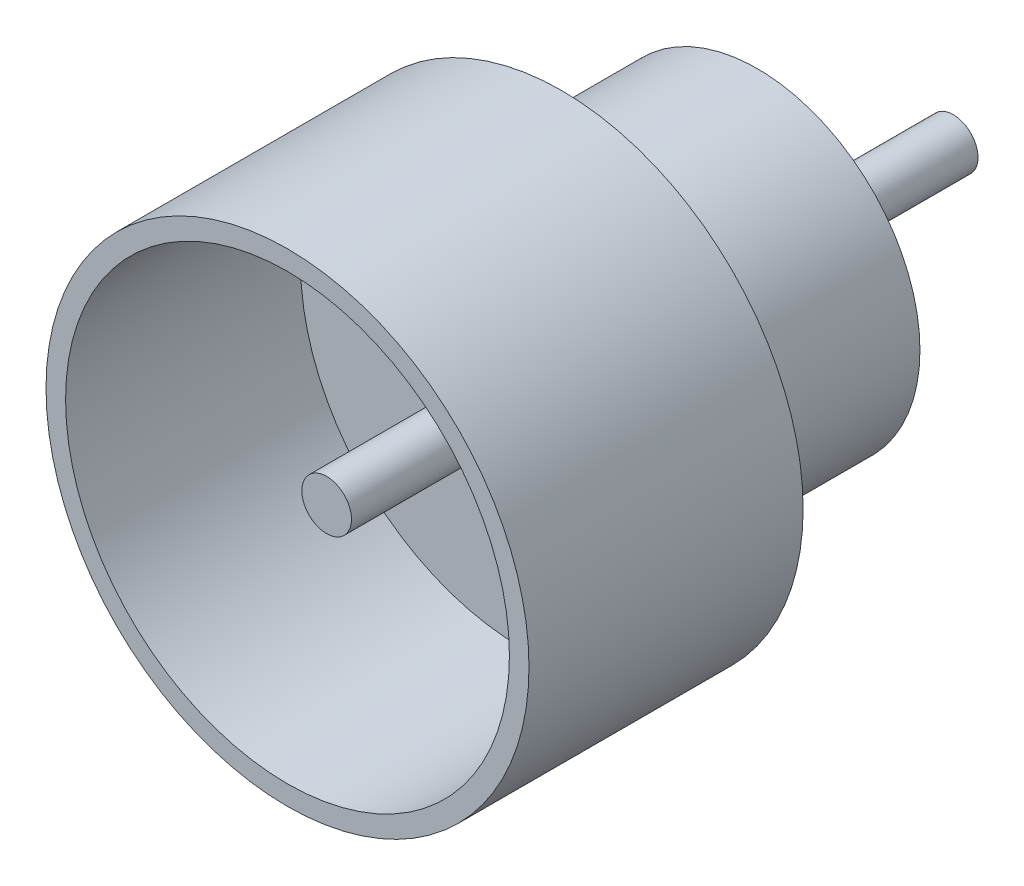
ISO-10303-21;
HEADER;
FILE_DESCRIPTION(('STEP AP214'),'2;1');
FILE_NAME('part.step','',(''),(''),'','','');
FILE_SCHEMA(('AUTOMOTIVE_DESIGN { 1 0 10303 214 1 1 1 1 }'));
ENDSEC;
DATA;
#1=APPLICATION_CONTEXT('core data for automotive mechanical design processes');
#2=APPLICATION_PROTOCOL_DEFINITION('international standard','automotive_design',2000,#1);
#3=PRODUCT_CONTEXT('',#1,'mechanical');
#4=PRODUCT('Part','Part','',(#3));
#5=PRODUCT_RELATED_PRODUCT_CATEGORY('part','',(#4));
#6=PRODUCT_DEFINITION_FORMATION('','',#4);
#7=PRODUCT_DEFINITION_CONTEXT('part definition',#1,'design');
#8=PRODUCT_DEFINITION('design','',#6,#7);
#9=PRODUCT_DEFINITION_SHAPE('','',#8);
#10=(LENGTH_UNIT() NAMED_UNIT(*) SI_UNIT(.MILLI.,.METRE.));
#11=(NAMED_UNIT(*) PLANE_ANGLE_UNIT() SI_UNIT($,.RADIAN.));
#12=(NAMED_UNIT(*) SI_UNIT($,.STERADIAN.) SOLID_ANGLE_UNIT());
#13=UNCERTAINTY_MEASURE_WITH_UNIT(LENGTH_MEASURE(1.E-05),#10,'distance_accuracy_value','');
#14=(GEOMETRIC_REPRESENTATION_CONTEXT(3) GLOBAL_UNCERTAINTY_ASSIGNED_CONTEXT((#13)) GLOBAL_UNIT_ASSIGNED_CONTEXT((#10,
#11,#12)) REPRESENTATION_CONTEXT('',''));
#15=CARTESIAN_POINT('',(0.,0.,0.));
#16=DIRECTION('',(0.,0.,1.));
#17=DIRECTION('',(1.,0.,0.));
#18=AXIS2_PLACEMENT_3D('',#15,#16,#17);
#19=CARTESIAN_POINT('',(0.,0.,-1.5));
#20=DIRECTION('',(0.,0.,-1.));
#21=DIRECTION('',(-1.,0.,0.));
#22=AXIS2_PLACEMENT_3D('',#19,#20,#21);
#23=PLANE('',#22);
#24=CARTESIAN_POINT('',(0.,0.,-1.5));
#25=DIRECTION('',(0.,0.,-1.));
#26=DIRECTION('',(-1.,0.,0.));
#27=AXIS2_PLACEMENT_3D('',#24,#25,#26);
#28=CIRCLE('',#27,1.245);
#29=CARTESIAN_POINT('',(-1.245,0.,-1.5));
#30=VERTEX_POINT('',#29);
#31=EDGE_CURVE('E60',#30,#30,#28,.T.);
#32=ORIENTED_EDGE('',*,*,#31,.T.);
#33=EDGE_LOOP('',(#32));
#34=FACE_BOUND('',#33,.T.);
#35=CARTESIAN_POINT('',(0.,0.,-1.5));
#36=DIRECTION('',(0.,0.,-1.));
#37=DIRECTION('',(-1.,0.,0.));
#38=AXIS2_PLACEMENT_3D('',#35,#36,#37);
#39=CIRCLE('',#38,0.19);
#40=CARTESIAN_POINT('',(-0.19,0.,-1.5));
#41=VERTEX_POINT('',#40);
#42=EDGE_CURVE('E66',#41,#41,#39,.T.);
#43=ORIENTED_EDGE('',*,*,#42,.F.);
#44=EDGE_LOOP('',(#43));
#45=FACE_BOUND('',#44,.T.);
#46=ADVANCED_FACE('F33',(#34,#45),#23,.T.);
#47=CARTESIAN_POINT('',(0.,0.,0.));
#48=DIRECTION('',(0.,0.,1.));
#49=DIRECTION('',(1.,0.,0.));
#50=AXIS2_PLACEMENT_3D('',#47,#48,#49);
#51=PLANE('',#50);
#52=CARTESIAN_POINT('',(0.,0.,0.));
#53=DIRECTION('',(0.,0.,1.));
#54=DIRECTION('',(1.,0.,0.));
#55=AXIS2_PLACEMENT_3D('',#52,#53,#54);
#56=CIRCLE('',#55,1.85);
#57=CARTESIAN_POINT('',(1.85,0.,0.));
#58=VERTEX_POINT('',#57);
#59=EDGE_CURVE('E44',#58,#58,#56,.T.);
#60=ORIENTED_EDGE('',*,*,#59,.F.);
#61=EDGE_LOOP('',(#60));
#62=FACE_BOUND('',#61,.T.);
#63=CARTESIAN_POINT('',(0.,0.,0.));
#64=DIRECTION('',(0.,0.,1.));
#65=DIRECTION('',(1.,0.,0.));
#66=AXIS2_PLACEMENT_3D('',#63,#64,#65);
#67=CIRCLE('',#66,1.245);
#68=CARTESIAN_POINT('',(1.245,0.,0.));
#69=VERTEX_POINT('',#68);
#70=EDGE_CURVE('E10',#69,#69,#67,.F.);
#71=ORIENTED_EDGE('',*,*,#70,.F.);
#72=EDGE_LOOP('',(#71));
#73=FACE_BOUND('',#72,.T.);
#74=ADVANCED_FACE('F82',(#62,#73),#51,.F.);
#75=CARTESIAN_POINT('',(0.,0.,0.3));
#76=DIRECTION('',(0.,0.,1.));
#77=DIRECTION('',(1.,0.,0.));
#78=AXIS2_PLACEMENT_3D('',#75,#76,#77);
#79=PLANE('',#78);
#80=CARTESIAN_POINT('',(0.,0.,0.3));
#81=DIRECTION('',(0.,0.,1.));
#82=DIRECTION('',(1.,0.,0.));
#83=AXIS2_PLACEMENT_3D('',#80,#81,#82);
#84=CIRCLE('',#83,1.7);
#85=CARTESIAN_POINT('',(1.7,0.,0.3));
#86=VERTEX_POINT('',#85);
#87=EDGE_CURVE('E49',#86,#86,#84,.T.);
#88=ORIENTED_EDGE('',*,*,#87,.T.);
#89=EDGE_LOOP('',(#88));
#90=FACE_BOUND('',#89,.T.);
#91=CARTESIAN_POINT('',(0.,0.,0.3));
#92=DIRECTION('',(0.,0.,1.));
#93=DIRECTION('',(1.,0.,0.));
#94=AXIS2_PLACEMENT_3D('',#91,#92,#93);
#95=CIRCLE('',#94,0.19);
#96=CARTESIAN_POINT('',(0.19,0.,0.3));
#97=VERTEX_POINT('',#96);
#98=EDGE_CURVE('E57',#97,#97,#95,.T.);
#99=ORIENTED_EDGE('',*,*,#98,.F.);
#100=EDGE_LOOP('',(#99));
#101=FACE_BOUND('',#100,.T.);
#102=ADVANCED_FACE('F88',(#90,#101),#79,.T.);
#103=CARTESIAN_POINT('',(0.,0.,2.1));
#104=DIRECTION('',(0.,0.,-1.));
#105=DIRECTION('',(-1.,0.,0.));
#106=AXIS2_PLACEMENT_3D('',#103,#104,#105);
#107=CYLINDRICAL_SURFACE('',#106,1.85);
#108=CARTESIAN_POINT('',(0.,0.,2.1));
#109=DIRECTION('',(0.,0.,1.));
#110=DIRECTION('',(1.,0.,0.));
#111=AXIS2_PLACEMENT_3D('',#108,#109,#110);
#112=CIRCLE('',#111,1.85);
#113=CARTESIAN_POINT('',(1.85,0.,2.1));
#114=VERTEX_POINT('',#113);
#115=EDGE_CURVE('E40',#114,#114,#112,.T.);
#116=ORIENTED_EDGE('',*,*,#115,.F.);
#117=EDGE_LOOP('',(#116));
#118=FACE_BOUND('',#117,.T.);
#119=ORIENTED_EDGE('',*,*,#59,.T.);
#120=EDGE_LOOP('',(#119));
#121=FACE_BOUND('',#120,.T.);
#122=ADVANCED_FACE('F35',(#118,#121),#107,.T.);
#123=CARTESIAN_POINT('',(0.,0.,2.1));
#124=DIRECTION('',(0.,0.,1.));
#125=DIRECTION('',(1.,0.,0.));
#126=AXIS2_PLACEMENT_3D('',#123,#124,#125);
#127=PLANE('',#126);
#128=CARTESIAN_POINT('',(0.,0.,2.1));
#129=DIRECTION('',(0.,0.,1.));
#130=DIRECTION('',(1.,0.,0.));
#131=AXIS2_PLACEMENT_3D('',#128,#129,#130);
#132=CIRCLE('',#131,1.7);
#133=CARTESIAN_POINT('',(1.7,0.,2.1));
#134=VERTEX_POINT('',#133);
#135=EDGE_CURVE('E51',#134,#134,#132,.T.);
#136=ORIENTED_EDGE('',*,*,#135,.F.);
#137=EDGE_LOOP('',(#136));
#138=FACE_BOUND('',#137,.T.);
#139=ORIENTED_EDGE('',*,*,#115,.T.);
#140=EDGE_LOOP('',(#139));
#141=FACE_BOUND('',#140,.T.);
#142=ADVANCED_FACE('F109',(#138,#141),#127,.T.);
#143=CARTESIAN_POINT('',(0.,0.,0.3));
#144=DIRECTION('',(0.,0.,1.));
#145=DIRECTION('',(1.,0.,0.));
#146=AXIS2_PLACEMENT_3D('',#143,#144,#145);
#147=CYLINDRICAL_SURFACE('',#146,1.7);
#148=ORIENTED_EDGE('',*,*,#87,.F.);
#149=EDGE_LOOP('',(#148));
#150=FACE_BOUND('',#149,.T.);
#151=ORIENTED_EDGE('',*,*,#135,.T.);
#152=EDGE_LOOP('',(#151));
#153=FACE_BOUND('',#152,.T.);
#154=ADVANCED_FACE('F102',(#150,#153),#147,.F.);
#155=CARTESIAN_POINT('',(0.,0.,1.8));
#156=DIRECTION('',(0.,0.,-1.));
#157=DIRECTION('',(-1.,0.,0.));
#158=AXIS2_PLACEMENT_3D('',#155,#156,#157);
#159=CYLINDRICAL_SURFACE('',#158,0.19);
#160=CARTESIAN_POINT('',(0.,0.,1.8));
#161=DIRECTION('',(0.,0.,1.));
#162=DIRECTION('',(1.,0.,0.));
#163=AXIS2_PLACEMENT_3D('',#160,#161,#162);
#164=CIRCLE('',#163,0.19);
#165=CARTESIAN_POINT('',(0.19,0.,1.8));
#166=VERTEX_POINT('',#165);
#167=EDGE_CURVE('E54',#166,#166,#164,.T.);
#168=ORIENTED_EDGE('',*,*,#167,.F.);
#169=EDGE_LOOP('',(#168));
#170=FACE_BOUND('',#169,.T.);
#171=ORIENTED_EDGE('',*,*,#98,.T.);
#172=EDGE_LOOP('',(#171));
#173=FACE_BOUND('',#172,.T.);
#174=ADVANCED_FACE('F98',(#170,#173),#159,.T.);
#175=CARTESIAN_POINT('',(0.,0.,1.8));
#176=DIRECTION('',(0.,0.,1.));
#177=DIRECTION('',(1.,0.,0.));
#178=AXIS2_PLACEMENT_3D('',#175,#176,#177);
#179=PLANE('',#178);
#180=ORIENTED_EDGE('',*,*,#167,.T.);
#181=EDGE_LOOP('',(#180));
#182=FACE_BOUND('',#181,.T.);
#183=ADVANCED_FACE('F94',(#182),#179,.T.);
#184=CARTESIAN_POINT('',(0.,0.,-1.5));
#185=DIRECTION('',(0.,0.,1.));
#186=DIRECTION('',(1.,0.,0.));
#187=AXIS2_PLACEMENT_3D('',#184,#185,#186);
#188=CYLINDRICAL_SURFACE('',#187,1.245);
#189=ORIENTED_EDGE('',*,*,#31,.F.);
#190=EDGE_LOOP('',(#189));
#191=FACE_BOUND('',#190,.T.);
#192=ORIENTED_EDGE('',*,*,#70,.T.);
#193=EDGE_LOOP('',(#192));
#194=FACE_BOUND('',#193,.T.);
#195=ADVANCED_FACE('F77',(#191,#194),#188,.T.);
#196=CARTESIAN_POINT('',(0.,0.,-3.));
#197=DIRECTION('',(0.,0.,1.));
#198=DIRECTION('',(1.,0.,0.));
#199=AXIS2_PLACEMENT_3D('',#196,#197,#198);
#200=CYLINDRICAL_SURFACE('',#199,0.19);
#201=CARTESIAN_POINT('',(0.,0.,-3.));
#202=DIRECTION('',(0.,0.,-1.));
#203=DIRECTION('',(-1.,0.,0.));
#204=AXIS2_PLACEMENT_3D('',#201,#202,#203);
#205=CIRCLE('',#204,0.19);
#206=CARTESIAN_POINT('',(-0.19,0.,-3.));
#207=VERTEX_POINT('',#206);
#208=EDGE_CURVE('E65',#207,#207,#205,.T.);
#209=ORIENTED_EDGE('',*,*,#208,.F.);
#210=EDGE_LOOP('',(#209));
#211=FACE_BOUND('',#210,.T.);
#212=ORIENTED_EDGE('',*,*,#42,.T.);
#213=EDGE_LOOP('',(#212));
#214=FACE_BOUND('',#213,.T.);
#215=ADVANCED_FACE('F74',(#211,#214),#200,.T.);
#216=CARTESIAN_POINT('',(0.,0.,-3.));
#217=DIRECTION('',(0.,0.,-1.));
#218=DIRECTION('',(-1.,0.,0.));
#219=AXIS2_PLACEMENT_3D('',#216,#217,#218);
#220=PLANE('',#219);
#221=ORIENTED_EDGE('',*,*,#208,.T.);
#222=EDGE_LOOP('',(#221));
#223=FACE_BOUND('',#222,.T.);
#224=ADVANCED_FACE('F72',(#223),#220,.T.);
#225=CLOSED_SHELL('',(#46,#74,#102,#122,#142,#154,#174,#183,#195,#215,#224));
#226=MANIFOLD_SOLID_BREP('B2',#225);
#227=ADVANCED_BREP_SHAPE_REPRESENTATION('',(#18,#226),#14);
#228=SHAPE_DEFINITION_REPRESENTATION(#9,#227);
ENDSEC;
END-ISO-10303-21;
